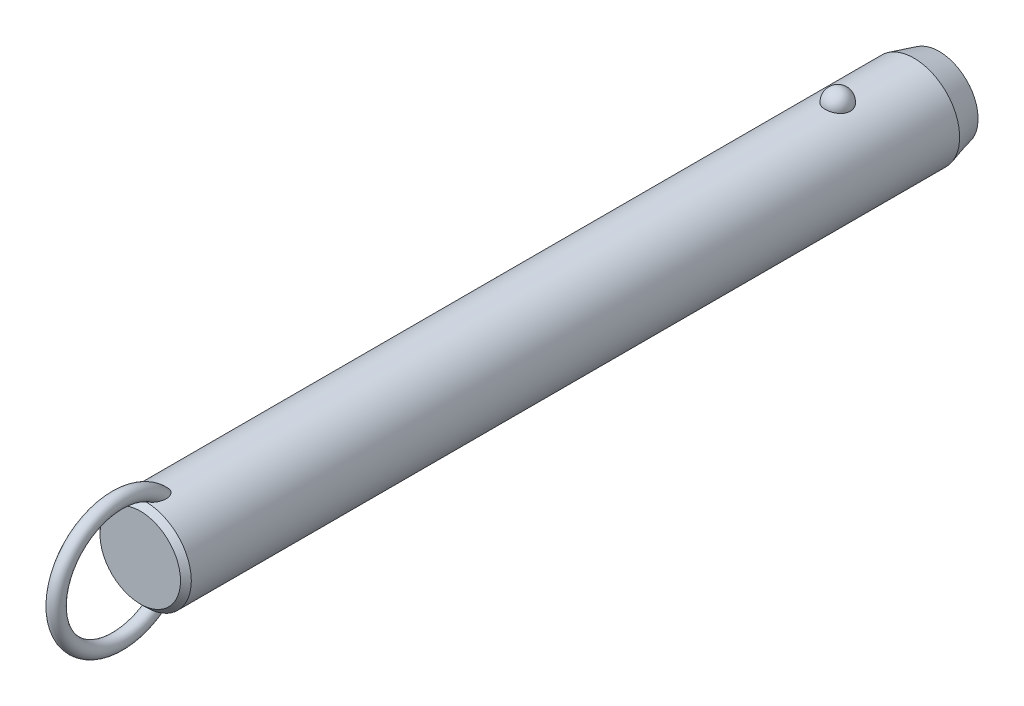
ISO-10303-21;
HEADER;
FILE_DESCRIPTION(('STEP AP214'),'2;1');
FILE_NAME('part.step','',(''),(''),'','','');
FILE_SCHEMA(('AUTOMOTIVE_DESIGN { 1 0 10303 214 1 1 1 1 }'));
ENDSEC;
DATA;
#1=APPLICATION_CONTEXT('core data for automotive mechanical design processes');
#2=APPLICATION_PROTOCOL_DEFINITION('international standard','automotive_design',2000,#1);
#3=PRODUCT_CONTEXT('',#1,'mechanical');
#4=PRODUCT('Part','Part','',(#3));
#5=PRODUCT_RELATED_PRODUCT_CATEGORY('part','',(#4));
#6=PRODUCT_DEFINITION_FORMATION('','',#4);
#7=PRODUCT_DEFINITION_CONTEXT('part definition',#1,'design');
#8=PRODUCT_DEFINITION('design','',#6,#7);
#9=PRODUCT_DEFINITION_SHAPE('','',#8);
#10=(LENGTH_UNIT() NAMED_UNIT(*) SI_UNIT(.MILLI.,.METRE.));
#11=(NAMED_UNIT(*) PLANE_ANGLE_UNIT() SI_UNIT($,.RADIAN.));
#12=(NAMED_UNIT(*) SI_UNIT($,.STERADIAN.) SOLID_ANGLE_UNIT());
#13=UNCERTAINTY_MEASURE_WITH_UNIT(LENGTH_MEASURE(1.E-05),#10,'distance_accuracy_value','');
#14=(GEOMETRIC_REPRESENTATION_CONTEXT(3) GLOBAL_UNCERTAINTY_ASSIGNED_CONTEXT((#13)) GLOBAL_UNIT_ASSIGNED_CONTEXT((#10,
#11,#12)) REPRESENTATION_CONTEXT('',''));
#15=CARTESIAN_POINT('',(0.,0.,0.));
#16=DIRECTION('',(0.,0.,1.));
#17=DIRECTION('',(1.,0.,0.));
#18=AXIS2_PLACEMENT_3D('',#15,#16,#17);
#19=CARTESIAN_POINT('',(0.,0.,177.8));
#20=DIRECTION('',(0.,0.,-1.));
#21=DIRECTION('',(-1.,0.,0.));
#22=AXIS2_PLACEMENT_3D('',#19,#20,#21);
#23=CYLINDRICAL_SURFACE('',#22,12.7);
#24=CARTESIAN_POINT('',(3.46661256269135,12.2177165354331,-3.50000000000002));
#25=CARTESIAN_POINT('',(3.4666090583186,12.2177194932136,-3.30432790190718));
#26=CARTESIAN_POINT('',(3.45063567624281,12.2222841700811,-3.10861112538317));
#27=CARTESIAN_POINT('',(3.38712451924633,12.2400345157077,-2.72271899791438));
#28=CARTESIAN_POINT('',(3.33957415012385,12.2532236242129,-2.53254588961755));
#29=CARTESIAN_POINT('',(3.2141234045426,12.286724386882,-2.16324948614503));
#30=CARTESIAN_POINT('',(3.13623639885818,12.3070329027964,-1.98412136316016));
#31=CARTESIAN_POINT('',(2.95205930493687,12.3525018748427,-1.6418059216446));
#32=CARTESIAN_POINT('',(2.84577003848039,12.3776621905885,-1.47861814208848));
#33=CARTESIAN_POINT('',(2.60688050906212,12.4301712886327,-1.17190583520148));
#34=CARTESIAN_POINT('',(2.47415697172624,12.4575299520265,-1.0284789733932));
#35=CARTESIAN_POINT('',(2.18615174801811,12.5112810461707,-0.766177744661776));
#36=CARTESIAN_POINT('',(2.03087002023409,12.5376734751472,-0.647303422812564));
#37=CARTESIAN_POINT('',(1.70237334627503,12.5864761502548,-0.437732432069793));
#38=CARTESIAN_POINT('',(1.52920948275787,12.6088972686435,-0.346958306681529));
#39=CARTESIAN_POINT('',(1.16944170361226,12.6473352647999,-0.195750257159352));
#40=CARTESIAN_POINT('',(0.982839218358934,12.663352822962,-0.135313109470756));
#41=CARTESIAN_POINT('',(0.604961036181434,12.6869706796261,-0.0473241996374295));
#42=CARTESIAN_POINT('',(0.41382314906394,12.6947125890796,-0.0192185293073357));
#43=CARTESIAN_POINT('',(0.0293827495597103,12.7014203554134,0.00517254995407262));
#44=CARTESIAN_POINT('',(-0.163919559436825,12.7003870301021,0.00146092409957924));
#45=CARTESIAN_POINT('',(-0.544374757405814,12.689735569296,-0.0373939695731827));
#46=CARTESIAN_POINT('',(-0.731575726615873,12.6802364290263,-0.0721015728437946));
#47=CARTESIAN_POINT('',(-1.09733277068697,12.6538333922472,-0.171364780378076));
#48=CARTESIAN_POINT('',(-1.27588869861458,12.6369293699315,-0.235920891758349));
#49=CARTESIAN_POINT('',(-1.6204698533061,12.5973946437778,-0.393548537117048));
#50=CARTESIAN_POINT('',(-1.78641865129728,12.5747321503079,-0.486778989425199));
#51=CARTESIAN_POINT('',(-2.10030671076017,12.5261316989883,-0.699110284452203));
#52=CARTESIAN_POINT('',(-2.24824419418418,12.5001934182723,-0.818213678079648));
#53=CARTESIAN_POINT('',(-2.52491489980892,12.4472906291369,-1.0815712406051));
#54=CARTESIAN_POINT('',(-2.65324222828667,12.4203160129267,-1.22624992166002));
#55=CARTESIAN_POINT('',(-2.88410007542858,12.3687509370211,-1.53528325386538));
#56=CARTESIAN_POINT('',(-2.98662883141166,12.3441606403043,-1.69963924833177));
#57=CARTESIAN_POINT('',(-3.16432417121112,12.2998199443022,-2.04548497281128));
#58=CARTESIAN_POINT('',(-3.23917525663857,12.2801261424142,-2.22714424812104));
#59=CARTESIAN_POINT('',(-3.35800573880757,12.248167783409,-2.60091389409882));
#60=CARTESIAN_POINT('',(-3.4019860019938,12.2359030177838,-2.79302397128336));
#61=CARTESIAN_POINT('',(-3.45784812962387,12.2202347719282,-3.18140279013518));
#62=CARTESIAN_POINT('',(-3.46986123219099,12.2167950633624,-3.37765118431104));
#63=CARTESIAN_POINT('',(-3.46186273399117,12.2190638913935,-3.76943689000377));
#64=CARTESIAN_POINT('',(-3.44185196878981,12.2247721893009,-3.96497421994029));
#65=CARTESIAN_POINT('',(-3.37048652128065,12.2446381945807,-4.34881728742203));
#66=CARTESIAN_POINT('',(-3.31928253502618,12.2587552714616,-4.53715319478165));
#67=CARTESIAN_POINT('',(-3.18693461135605,12.2938237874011,-4.9023172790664));
#68=CARTESIAN_POINT('',(-3.1057895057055,12.3147754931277,-5.07914500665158));
#69=CARTESIAN_POINT('',(-2.91506431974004,12.3613125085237,-5.41732059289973));
#70=CARTESIAN_POINT('',(-2.80533587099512,12.3869217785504,-5.57858147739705));
#71=CARTESIAN_POINT('',(-2.560414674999,12.4398525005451,-5.88013283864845));
#72=CARTESIAN_POINT('',(-2.42522099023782,12.4671740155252,-6.02042254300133));
#73=CARTESIAN_POINT('',(-2.1323357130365,12.5205965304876,-6.27662798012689));
#74=CARTESIAN_POINT('',(-1.97456596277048,12.5466928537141,-6.39245542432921));
#75=CARTESIAN_POINT('',(-1.64115839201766,12.5946384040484,-6.59583547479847));
#76=CARTESIAN_POINT('',(-1.46552179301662,12.6164879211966,-6.68339001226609));
#77=CARTESIAN_POINT('',(-1.10356050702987,12.6532533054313,-6.82682153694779));
#78=CARTESIAN_POINT('',(-0.9173913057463,12.6682500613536,-6.88306988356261));
#79=CARTESIAN_POINT('',(-0.537836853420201,12.6900288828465,-6.96386887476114));
#80=CARTESIAN_POINT('',(-0.344452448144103,12.6968119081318,-6.98842322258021));
#81=CARTESIAN_POINT('',(0.0402577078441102,12.7013667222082,-7.00496469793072));
#82=CARTESIAN_POINT('',(0.231556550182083,12.6993008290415,-6.99753844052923));
#83=CARTESIAN_POINT('',(0.610105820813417,12.6867505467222,-6.95166366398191));
#84=CARTESIAN_POINT('',(0.797356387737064,12.6762664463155,-6.91321620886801));
#85=CARTESIAN_POINT('',(1.16186657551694,12.6480587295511,-6.80658431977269));
#86=CARTESIAN_POINT('',(1.33915951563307,12.6303611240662,-6.73850666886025));
#87=CARTESIAN_POINT('',(1.67968518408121,12.5896027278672,-6.57450875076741));
#88=CARTESIAN_POINT('',(1.84291705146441,12.5665416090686,-6.47858678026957));
#89=CARTESIAN_POINT('',(2.15340192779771,12.5171072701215,-6.25982455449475));
#90=CARTESIAN_POINT('',(2.30037831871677,12.4906895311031,-6.13660186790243));
#91=CARTESIAN_POINT('',(2.5717412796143,12.4376567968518,-5.86739587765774));
#92=CARTESIAN_POINT('',(2.69612388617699,12.4110417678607,-5.72140858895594));
#93=CARTESIAN_POINT('',(2.92107785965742,12.360051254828,-5.40794137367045));
#94=CARTESIAN_POINT('',(3.02121329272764,12.3357209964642,-5.24014110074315));
#95=CARTESIAN_POINT('',(3.19236291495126,12.2925446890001,-4.88969865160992));
#96=CARTESIAN_POINT('',(3.26338839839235,12.2736965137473,-4.70706226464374));
#97=CARTESIAN_POINT('',(3.36788038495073,12.245404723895,-4.35469510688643));
#98=CARTESIAN_POINT('',(3.40484026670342,12.2351018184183,-4.18605935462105));
#99=CARTESIAN_POINT('',(3.45420764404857,12.2212564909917,-3.84496058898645));
#100=CARTESIAN_POINT('',(3.46661565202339,12.2177139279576,-3.67249765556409));
#101=CARTESIAN_POINT('',(3.46661256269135,12.2177165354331,-3.50000000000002));
#102=B_SPLINE_CURVE_WITH_KNOTS('',3,(#24,#25,#26,#27,#28,#29,#30,#31,#32,#33,#34,#35,#36,#37,
#38,#39,#40,#41,#42,#43,#44,#45,#46,#47,#48,#49,#50,#51,#52,#53,#54,#55,#56,#57,#58,#59,#60,#61,
#62,#63,#64,#65,#66,#67,#68,#69,#70,#71,#72,#73,#74,#75,#76,#77,#78,#79,#80,#81,#82,#83,#84,#85,
#86,#87,#88,#89,#90,#91,#92,#93,#94,#95,#96,#97,#98,#99,#100,#101),.UNSPECIFIED.,.T.,.F.,(4,2,2,
2,2,2,2,2,2,2,2,2,2,2,2,2,2,2,2,2,2,2,2,2,2,2,2,2,2,2,2,2,2,2,2,2,2,2,4),(0.,0.586396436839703,
1.17302689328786,1.7593990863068,2.34575431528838,2.93491084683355,3.52406845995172,
4.11158733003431,4.69904375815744,5.2762784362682,5.85345931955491,6.42265312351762,
6.99185659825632,7.56427334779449,8.136746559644,8.71981013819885,9.3029135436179,
9.89247258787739,10.4820150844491,11.0691335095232,11.6562366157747,12.2405256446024,
12.8248374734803,13.412244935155,13.9996740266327,14.5891883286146,15.1786623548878,
15.7609861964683,16.3432419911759,16.9148635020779,17.4864654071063,18.0560241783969,
18.6256177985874,19.2037609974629,19.7820055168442,20.3699810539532,20.957728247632,
21.4746855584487,21.9916320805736),.UNSPECIFIED.);
#103=CARTESIAN_POINT('',(3.46661256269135,12.2177165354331,-3.50000000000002));
#104=VERTEX_POINT('',#103);
#105=EDGE_CURVE('E41',#104,#104,#102,.T.);
#106=ORIENTED_EDGE('',*,*,#105,.T.);
#107=EDGE_LOOP('',(#106));
#108=FACE_BOUND('',#107,.T.);
#109=CARTESIAN_POINT('',(0.,0.,189.));
#110=DIRECTION('',(0.,0.,1.));
#111=DIRECTION('',(1.,0.,0.));
#112=AXIS2_PLACEMENT_3D('',#109,#110,#111);
#113=CIRCLE('',#112,12.7);
#114=CARTESIAN_POINT('',(12.7,0.,189.));
#115=VERTEX_POINT('',#114);
#116=EDGE_CURVE('E10',#115,#115,#113,.F.);
#117=ORIENTED_EDGE('',*,*,#116,.T.);
#118=EDGE_LOOP('',(#117));
#119=FACE_BOUND('',#118,.T.);
#120=CARTESIAN_POINT('',(-0.548122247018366,-12.6881662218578,182.743218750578));
#121=CARTESIAN_POINT('',(-0.648865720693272,-12.6838128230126,182.777926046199));
#122=CARTESIAN_POINT('',(-0.746398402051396,-12.6783867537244,182.822042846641));
#123=CARTESIAN_POINT('',(-0.932125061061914,-12.666091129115,182.926764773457));
#124=CARTESIAN_POINT('',(-1.02030388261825,-12.6592192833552,182.987396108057));
#125=CARTESIAN_POINT('',(-1.18487740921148,-12.6448747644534,183.121847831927));
#126=CARTESIAN_POINT('',(-1.26134296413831,-12.637406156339,183.195582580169));
#127=CARTESIAN_POINT('',(-1.4023120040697,-12.6225412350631,183.353604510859));
#128=CARTESIAN_POINT('',(-1.466814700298,-12.6151449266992,183.43789238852));
#129=CARTESIAN_POINT('',(-1.60714786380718,-12.5981718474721,183.649657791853));
#130=CARTESIAN_POINT('',(-1.67725126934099,-12.588900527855,183.780962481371));
#131=CARTESIAN_POINT('',(-1.79536591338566,-12.5725964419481,184.053247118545));
#132=CARTESIAN_POINT('',(-1.84333535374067,-12.5655679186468,184.194244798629));
#133=CARTESIAN_POINT('',(-1.93422576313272,-12.5519624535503,184.537645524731));
#134=CARTESIAN_POINT('',(-1.96788773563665,-12.5466298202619,184.742557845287));
#135=CARTESIAN_POINT('',(-1.9941399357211,-12.542463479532,185.051760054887));
#136=CARTESIAN_POINT('',(-1.99883864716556,-12.5417153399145,185.155298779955));
#137=CARTESIAN_POINT('',(-2.00078003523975,-12.5414074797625,185.36245124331));
#138=CARTESIAN_POINT('',(-1.99802449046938,-12.5418474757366,185.466064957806));
#139=CARTESIAN_POINT('',(-1.98336733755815,-12.5441750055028,185.71032076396));
#140=CARTESIAN_POINT('',(-1.96851430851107,-12.5465291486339,185.850780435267));
#141=CARTESIAN_POINT('',(-1.92707089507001,-12.5529612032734,186.129960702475));
#142=CARTESIAN_POINT('',(-1.90047458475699,-12.5570399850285,186.268680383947));
#143=CARTESIAN_POINT('',(-1.8361912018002,-12.5666008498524,186.54341135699));
#144=CARTESIAN_POINT('',(-1.79850828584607,-12.57208240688,186.679423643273));
#145=CARTESIAN_POINT('',(-1.71223796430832,-12.5841228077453,186.947842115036));
#146=CARTESIAN_POINT('',(-1.66365679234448,-12.5906810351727,187.080250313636));
#147=CARTESIAN_POINT('',(-1.5780450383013,-12.6016176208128,187.28548877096));
#148=CARTESIAN_POINT('',(-1.54477252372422,-12.6057501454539,187.359914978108));
#149=CARTESIAN_POINT('',(-1.47424480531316,-12.6141930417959,187.506839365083));
#150=CARTESIAN_POINT('',(-1.436990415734,-12.6185033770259,187.579337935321));
#151=CARTESIAN_POINT('',(-1.35825795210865,-12.6272207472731,187.721892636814));
#152=CARTESIAN_POINT('',(-1.31678520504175,-12.6316276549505,187.791951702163));
#153=CARTESIAN_POINT('',(-1.22917793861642,-12.6404532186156,187.929070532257));
#154=CARTESIAN_POINT('',(-1.18304514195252,-12.6448718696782,187.996131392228));
#155=CARTESIAN_POINT('',(-1.07246411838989,-12.6547893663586,188.143874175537));
#156=CARTESIAN_POINT('',(-1.00642239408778,-12.6602600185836,188.223384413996));
#157=CARTESIAN_POINT('',(-0.86444142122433,-12.6707460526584,188.373169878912));
#158=CARTESIAN_POINT('',(-0.788516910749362,-12.6757620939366,188.443458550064));
#159=CARTESIAN_POINT('',(-0.652215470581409,-12.6833591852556,188.548680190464));
#160=CARTESIAN_POINT('',(-0.59498203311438,-12.6861973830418,188.587624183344));
#161=CARTESIAN_POINT('',(-0.475269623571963,-12.6912445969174,188.656489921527));
#162=CARTESIAN_POINT('',(-0.412800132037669,-12.6934547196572,188.686427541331));
#163=CARTESIAN_POINT('',(-0.295749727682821,-12.6966636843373,188.729756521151));
#164=CARTESIAN_POINT('',(-0.241949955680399,-12.6978134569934,188.745218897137));
#165=CARTESIAN_POINT('',(-0.132508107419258,-12.6994261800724,188.766884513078));
#166=CARTESIAN_POINT('',(-0.0768679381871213,-12.6998898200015,188.773097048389));
#167=CARTESIAN_POINT('',(0.0347696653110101,-12.7000752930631,188.775583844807));
#168=CARTESIAN_POINT('',(0.0907676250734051,-12.6997954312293,188.771835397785));
#169=CARTESIAN_POINT('',(0.201283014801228,-12.6985255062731,188.754788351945));
#170=CARTESIAN_POINT('',(0.255799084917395,-12.6975348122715,188.741481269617));
#171=CARTESIAN_POINT('',(0.376042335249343,-12.6946091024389,188.70203792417));
#172=CARTESIAN_POINT('',(0.440950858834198,-12.6924943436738,188.673449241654));
#173=CARTESIAN_POINT('',(0.565350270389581,-12.6875639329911,188.606323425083));
#174=CARTESIAN_POINT('',(0.624828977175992,-12.6847467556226,188.567764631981));
#175=CARTESIAN_POINT('',(0.774116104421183,-12.6767252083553,188.456949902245));
#176=CARTESIAN_POINT('',(0.859449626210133,-12.6711344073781,188.378760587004));
#177=CARTESIAN_POINT('',(1.01789440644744,-12.6593922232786,188.210943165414));
#178=CARTESIAN_POINT('',(1.09096902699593,-12.653239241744,188.121282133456));
#179=CARTESIAN_POINT('',(1.22268793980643,-12.6411674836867,187.940265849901));
#180=CARTESIAN_POINT('',(1.28193986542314,-12.6352572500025,187.849345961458));
#181=CARTESIAN_POINT('',(1.39259777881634,-12.6235401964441,187.662792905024));
#182=CARTESIAN_POINT('',(1.44399707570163,-12.6177334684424,187.567155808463));
#183=CARTESIAN_POINT('',(1.53972870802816,-12.6064093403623,187.372273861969));
#184=CARTESIAN_POINT('',(1.58405262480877,-12.6008922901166,187.273024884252));
#185=CARTESIAN_POINT('',(1.66600705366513,-12.5903187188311,187.071772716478));
#186=CARTESIAN_POINT('',(1.70363651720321,-12.5852622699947,186.969769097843));
#187=CARTESIAN_POINT('',(1.77545379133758,-12.5753406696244,186.754358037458));
#188=CARTESIAN_POINT('',(1.80903453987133,-12.5705328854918,186.640745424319));
#189=CARTESIAN_POINT('',(1.86844163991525,-12.5618400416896,186.411457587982));
#190=CARTESIAN_POINT('',(1.89426665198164,-12.5579551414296,186.295782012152));
#191=CARTESIAN_POINT('',(1.9378546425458,-12.5513030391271,186.063007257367));
#192=CARTESIAN_POINT('',(1.9556264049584,-12.5485346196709,185.945909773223));
#193=CARTESIAN_POINT('',(1.98264463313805,-12.5442934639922,185.710747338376));
#194=CARTESIAN_POINT('',(1.99189298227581,-12.5428204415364,185.59268260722));
#195=CARTESIAN_POINT('',(2.00416068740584,-12.540871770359,185.280622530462));
#196=CARTESIAN_POINT('',(1.99944433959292,-12.541631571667,185.086229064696));
#197=CARTESIAN_POINT('',(1.96113755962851,-12.5476846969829,184.700309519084));
#198=CARTESIAN_POINT('',(1.92758341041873,-12.5529723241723,184.508780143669));
#199=CARTESIAN_POINT('',(1.83934342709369,-12.5661532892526,184.182272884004));
#200=CARTESIAN_POINT('',(1.79215440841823,-12.5730485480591,184.04524997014));
#201=CARTESIAN_POINT('',(1.67676242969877,-12.588958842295,183.780445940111));
#202=CARTESIAN_POINT('',(1.60859050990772,-12.597970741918,183.652651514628));
#203=CARTESIAN_POINT('',(1.46583832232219,-12.6152829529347,183.435800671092));
#204=CARTESIAN_POINT('',(1.39525727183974,-12.6233659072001,183.34410500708));
#205=CARTESIAN_POINT('',(1.23992594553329,-12.6395676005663,183.173485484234));
#206=CARTESIAN_POINT('',(1.15517932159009,-12.6476863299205,183.094558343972));
#207=CARTESIAN_POINT('',(0.971995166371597,-12.6630846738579,182.952643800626));
#208=CARTESIAN_POINT('',(0.873456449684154,-12.6703572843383,182.889784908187));
#209=CARTESIAN_POINT('',(0.665847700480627,-12.6829569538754,182.784487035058));
#210=CARTESIAN_POINT('',(0.556784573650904,-12.688285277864,182.742034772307));
#211=CARTESIAN_POINT('',(0.347338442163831,-12.6956226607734,182.684443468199));
#212=CARTESIAN_POINT('',(0.247759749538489,-12.6979816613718,182.666399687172));
#213=CARTESIAN_POINT('',(0.0470218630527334,-12.7003077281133,182.648600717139));
#214=CARTESIAN_POINT('',(-0.0541350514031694,-12.7002779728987,182.648821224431));
#215=CARTESIAN_POINT('',(-0.221414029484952,-12.6982482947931,182.664363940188));
#216=CARTESIAN_POINT('',(-0.288055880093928,-12.6969033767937,182.674666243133));
#217=CARTESIAN_POINT('',(-0.419599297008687,-12.6932369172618,182.70313489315));
#218=CARTESIAN_POINT('',(-0.484501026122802,-12.6909154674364,182.721300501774));
#219=CARTESIAN_POINT('',(-0.548122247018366,-12.6881662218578,182.743218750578));
#220=B_SPLINE_CURVE_WITH_KNOTS('',3,(#120,#121,#122,#123,#124,#125,#126,#127,#128,#129,#130,
#131,#132,#133,#134,#135,#136,#137,#138,#139,#140,#141,#142,#143,#144,#145,#146,#147,#148,#149,
#150,#151,#152,#153,#154,#155,#156,#157,#158,#159,#160,#161,#162,#163,#164,#165,#166,#167,#168,
#169,#170,#171,#172,#173,#174,#175,#176,#177,#178,#179,#180,#181,#182,#183,#184,#185,#186,#187,
#188,#189,#190,#191,#192,#193,#194,#195,#196,#197,#198,#199,#200,#201,#202,#203,#204,#205,#206,
#207,#208,#209,#210,#211,#212,#213,#214,#215,#216,#217,#218,#219),.UNSPECIFIED.,.T.,.F.,(4,2,2,
2,2,2,2,2,2,2,2,2,2,2,2,2,2,2,2,2,2,2,2,2,2,2,2,2,2,2,2,2,2,2,2,2,2,2,2,2,2,2,2,2,2,2,2,2,2,4),
(0.,0.31964225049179,0.639794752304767,0.957927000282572,1.27608021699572,1.72100165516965,
2.16675988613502,2.78630021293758,3.09705782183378,3.40774128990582,3.83096358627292,
4.25439969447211,4.67767724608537,5.10071330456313,5.34550297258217,5.59024267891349,
5.83467707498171,6.07902143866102,6.38891080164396,6.69834321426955,6.9056091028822,
7.11250749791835,7.27977315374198,7.44687060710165,7.61434932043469,7.78197685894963,
7.99365544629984,8.20579780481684,8.55147335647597,8.89816429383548,9.22375138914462,
9.54961437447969,9.8758622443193,10.202161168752,10.557587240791,10.9130746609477,
11.2681734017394,11.6231936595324,12.2046601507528,12.7853961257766,13.219164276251,
13.6522938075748,13.9989174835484,14.3454519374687,14.6946768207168,15.0436740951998,
15.3457513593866,15.6474266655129,15.8493051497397,16.0511646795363),.UNSPECIFIED.);
#221=CARTESIAN_POINT('',(-0.548122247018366,-12.6881662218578,182.743218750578));
#222=VERTEX_POINT('',#221);
#223=EDGE_CURVE('E60',#222,#222,#220,.T.);
#224=ORIENTED_EDGE('',*,*,#223,.T.);
#225=EDGE_LOOP('',(#224));
#226=FACE_BOUND('',#225,.T.);
#227=CARTESIAN_POINT('',(-0.548122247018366,12.6881662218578,182.743218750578));
#228=CARTESIAN_POINT('',(-0.459436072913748,12.6919968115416,182.712673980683));
#229=CARTESIAN_POINT('',(-0.368189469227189,12.6949996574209,182.689391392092));
#230=CARTESIAN_POINT('',(-0.183024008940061,12.6990186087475,182.658406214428));
#231=CARTESIAN_POINT('',(-0.0891049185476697,12.7000345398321,182.650704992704));
#232=CARTESIAN_POINT('',(0.098714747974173,12.6999636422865,182.651245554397));
#233=CARTESIAN_POINT('',(0.192615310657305,12.6988761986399,182.659492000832));
#234=CARTESIAN_POINT('',(0.377658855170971,12.6947211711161,182.691551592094));
#235=CARTESIAN_POINT('',(0.468801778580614,12.6916535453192,182.715365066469));
#236=CARTESIAN_POINT('',(0.645809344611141,12.6838788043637,182.77745651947));
#237=CARTESIAN_POINT('',(0.731679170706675,12.6791733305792,182.815720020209));
#238=CARTESIAN_POINT('',(0.896315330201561,12.6686004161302,182.905120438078));
#239=CARTESIAN_POINT('',(0.975080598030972,12.6627328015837,182.956259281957));
#240=CARTESIAN_POINT('',(1.12963655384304,12.6499161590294,183.07367820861));
#241=CARTESIAN_POINT('',(1.20478673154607,12.6429194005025,183.140792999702));
#242=CARTESIAN_POINT('',(1.34448241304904,12.6288282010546,183.28522507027));
#243=CARTESIAN_POINT('',(1.40902173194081,12.621733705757,183.362548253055));
#244=CARTESIAN_POINT('',(1.55208211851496,12.6050877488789,183.559247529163));
#245=CARTESIAN_POINT('',(1.62510490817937,12.5957546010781,183.682654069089));
#246=CARTESIAN_POINT('',(1.7501904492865,12.5789823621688,183.939769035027));
#247=CARTESIAN_POINT('',(1.80221377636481,12.5715468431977,184.073496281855));
#248=CARTESIAN_POINT('',(1.90309965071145,12.5567434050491,184.398351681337));
#249=CARTESIAN_POINT('',(1.94342317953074,12.5504515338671,184.592161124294));
#250=CARTESIAN_POINT('',(1.99332997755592,12.5426147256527,184.98378810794));
#251=CARTESIAN_POINT('',(2.00285305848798,12.5410790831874,185.181612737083));
#252=CARTESIAN_POINT('',(1.99678999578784,12.5420407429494,185.516642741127));
#253=CARTESIAN_POINT('',(1.98794117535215,12.5434564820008,185.654042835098));
#254=CARTESIAN_POINT('',(1.95865119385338,12.5480641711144,185.927639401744));
#255=CARTESIAN_POINT('',(1.93820436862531,12.5512569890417,186.063835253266));
#256=CARTESIAN_POINT('',(1.88647896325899,12.5591352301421,186.334249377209));
#257=CARTESIAN_POINT('',(1.85518800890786,12.5638223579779,186.468465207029));
#258=CARTESIAN_POINT('',(1.78217886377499,12.5743868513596,186.733936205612));
#259=CARTESIAN_POINT('',(1.74046509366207,12.5802637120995,186.865192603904));
#260=CARTESIAN_POINT('',(1.66024095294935,12.5910571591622,187.086085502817));
#261=CARTESIAN_POINT('',(1.62434772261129,12.5957535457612,187.176690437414));
#262=CARTESIAN_POINT('',(1.54709009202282,12.6054762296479,187.355512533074));
#263=CARTESIAN_POINT('',(1.50572681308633,12.6105024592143,187.443730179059));
#264=CARTESIAN_POINT('',(1.41728020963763,12.620748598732,187.616932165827));
#265=CARTESIAN_POINT('',(1.37021377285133,12.625967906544,187.701925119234));
#266=CARTESIAN_POINT('',(1.26969620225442,12.6364721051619,187.868007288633));
#267=CARTESIAN_POINT('',(1.21624929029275,12.6417569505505,187.949099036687));
#268=CARTESIAN_POINT('',(1.10304413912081,12.6521331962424,188.104702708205));
#269=CARTESIAN_POINT('',(1.04340936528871,12.657226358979,188.179303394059));
#270=CARTESIAN_POINT('',(0.915919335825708,12.667090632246,188.321324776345));
#271=CARTESIAN_POINT('',(0.848064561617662,12.6718617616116,188.38874589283));
#272=CARTESIAN_POINT('',(0.717035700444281,12.67987711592,188.500624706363));
#273=CARTESIAN_POINT('',(0.655526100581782,12.6832377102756,188.546997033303));
#274=CARTESIAN_POINT('',(0.525985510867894,12.6892676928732,188.629619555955));
#275=CARTESIAN_POINT('',(0.457969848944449,12.6919386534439,188.665892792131));
#276=CARTESIAN_POINT('',(0.334859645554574,12.695691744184,188.716657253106));
#277=CARTESIAN_POINT('',(0.281116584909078,12.6970073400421,188.734373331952));
#278=CARTESIAN_POINT('',(0.171425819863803,12.6989609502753,188.760642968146));
#279=CARTESIAN_POINT('',(0.115480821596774,12.699599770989,188.769207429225));
#280=CARTESIAN_POINT('',(0.00272618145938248,12.7001251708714,188.776253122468));
#281=CARTESIAN_POINT('',(-0.054085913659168,12.7000089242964,188.774696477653));
#282=CARTESIAN_POINT('',(-0.166544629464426,12.6990328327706,188.761600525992));
#283=CARTESIAN_POINT('',(-0.222190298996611,12.6981724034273,188.750053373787));
#284=CARTESIAN_POINT('',(-0.342018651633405,12.695562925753,188.714912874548));
#285=CARTESIAN_POINT('',(-0.405606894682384,12.6936676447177,188.68933225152));
#286=CARTESIAN_POINT('',(-0.527815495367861,12.6891754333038,188.628311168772));
#287=CARTESIAN_POINT('',(-0.586425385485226,12.6865770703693,188.592850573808));
#288=CARTESIAN_POINT('',(-0.731842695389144,12.6792129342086,188.491496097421));
#289=CARTESIAN_POINT('',(-0.81470941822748,12.6740767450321,188.4200395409));
#290=CARTESIAN_POINT('',(-0.969101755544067,12.6632083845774,188.26589007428));
#291=CARTESIAN_POINT('',(-1.04059564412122,12.6574746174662,188.183166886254));
#292=CARTESIAN_POINT('',(-1.16981116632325,12.6461638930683,188.015809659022));
#293=CARTESIAN_POINT('',(-1.22811369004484,12.6405994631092,187.931616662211));
#294=CARTESIAN_POINT('',(-1.33743405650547,12.6295007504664,187.758579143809));
#295=CARTESIAN_POINT('',(-1.38844577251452,12.6239664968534,187.669730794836));
#296=CARTESIAN_POINT('',(-1.48400702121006,12.6130898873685,187.488389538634));
#297=CARTESIAN_POINT('',(-1.52854232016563,12.6077479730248,187.395889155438));
#298=CARTESIAN_POINT('',(-1.61150113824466,12.5974127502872,187.208160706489));
#299=CARTESIAN_POINT('',(-1.64992317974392,12.5924195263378,187.112931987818));
#300=CARTESIAN_POINT('',(-1.73468589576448,12.581070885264,186.88289362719));
#301=CARTESIAN_POINT('',(-1.77831261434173,12.5749388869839,186.747066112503));
#302=CARTESIAN_POINT('',(-1.85439734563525,12.5639437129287,186.472212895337));
#303=CARTESIAN_POINT('',(-1.88684994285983,12.5590811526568,186.333185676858));
#304=CARTESIAN_POINT('',(-1.94008483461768,12.550968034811,186.05309235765));
#305=CARTESIAN_POINT('',(-1.96088706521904,12.5477147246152,185.912030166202));
#306=CARTESIAN_POINT('',(-1.99000539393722,12.5431291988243,185.628668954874));
#307=CARTESIAN_POINT('',(-1.99832911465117,12.5417958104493,185.486370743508));
#308=CARTESIAN_POINT('',(-2.00166624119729,12.5412674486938,185.157627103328));
#309=CARTESIAN_POINT('',(-1.99178843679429,12.5428579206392,184.971088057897));
#310=CARTESIAN_POINT('',(-1.94455183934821,12.5502731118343,184.60162404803));
#311=CARTESIAN_POINT('',(-1.90724032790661,12.5560905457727,184.418693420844));
#312=CARTESIAN_POINT('',(-1.81330718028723,12.5699462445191,184.104848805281));
#313=CARTESIAN_POINT('',(-1.76338820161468,12.5771273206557,183.971910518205));
#314=CARTESIAN_POINT('',(-1.64305018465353,12.593414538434,183.715681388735));
#315=CARTESIAN_POINT('',(-1.57265346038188,12.6025185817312,183.592380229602));
#316=CARTESIAN_POINT('',(-1.42634956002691,12.6198178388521,183.383564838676));
#317=CARTESIAN_POINT('',(-1.35423772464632,12.6278405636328,183.295384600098));
#318=CARTESIAN_POINT('',(-1.19645664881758,12.6437632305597,183.132107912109));
#319=CARTESIAN_POINT('',(-1.1108053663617,12.6516633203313,183.056994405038));
#320=CARTESIAN_POINT('',(-0.947219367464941,12.6648319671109,182.937811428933));
#321=CARTESIAN_POINT('',(-0.871624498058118,12.670300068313,182.890541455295));
#322=CARTESIAN_POINT('',(-0.714161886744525,12.6801492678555,182.8077413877));
#323=CARTESIAN_POINT('',(-0.632295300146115,12.684530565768,182.77220913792));
#324=CARTESIAN_POINT('',(-0.548122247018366,12.6881662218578,182.743218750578));
#325=B_SPLINE_CURVE_WITH_KNOTS('',3,(#227,#228,#229,#230,#231,#232,#233,#234,#235,#236,#237,
#238,#239,#240,#241,#242,#243,#244,#245,#246,#247,#248,#249,#250,#251,#252,#253,#254,#255,#256,
#257,#258,#259,#260,#261,#262,#263,#264,#265,#266,#267,#268,#269,#270,#271,#272,#273,#274,#275,
#276,#277,#278,#279,#280,#281,#282,#283,#284,#285,#286,#287,#288,#289,#290,#291,#292,#293,#294,
#295,#296,#297,#298,#299,#300,#301,#302,#303,#304,#305,#306,#307,#308,#309,#310,#311,#312,#313,
#314,#315,#316,#317,#318,#319,#320,#321,#322,#323,#324),.UNSPECIFIED.,.T.,.F.,(4,2,2,2,2,2,2,2,
2,2,2,2,2,2,2,2,2,2,2,2,2,2,2,2,2,2,2,2,2,2,2,2,2,2,2,2,2,2,2,2,2,2,2,2,2,2,2,2,4),(0.,
0.281328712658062,0.562682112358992,0.844117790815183,1.12555942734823,1.40671982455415,
1.68792232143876,1.98972294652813,2.29169886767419,2.72039860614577,3.14989948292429,
3.74084916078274,4.33295293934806,4.74554109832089,5.15833092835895,5.57159335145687,
5.98468079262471,6.27722775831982,6.56971484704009,6.86135609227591,7.15280542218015,
7.43927407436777,7.72572595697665,7.95635862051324,8.18646071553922,8.35559393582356,
8.52452541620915,8.69408946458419,8.86378678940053,9.06834348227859,9.27332014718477,
9.60010414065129,9.92778432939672,10.2350252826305,10.5425229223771,10.8506864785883,
11.15892440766,11.5867893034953,12.0148612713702,12.4421984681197,12.8692745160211,
13.4279365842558,13.9856380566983,14.4107062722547,14.835313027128,15.1765567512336,
15.517351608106,15.7844129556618,16.051425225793),.UNSPECIFIED.);
#326=CARTESIAN_POINT('',(-0.548122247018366,12.6881662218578,182.743218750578));
#327=VERTEX_POINT('',#326);
#328=EDGE_CURVE('E68',#327,#327,#325,.T.);
#329=ORIENTED_EDGE('',*,*,#328,.T.);
#330=EDGE_LOOP('',(#329));
#331=FACE_BOUND('',#330,.T.);
#332=CARTESIAN_POINT('',(0.,0.,-24.6999999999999));
#333=DIRECTION('',(0.,0.,-1.));
#334=DIRECTION('',(-1.,0.,0.));
#335=AXIS2_PLACEMENT_3D('',#332,#333,#334);
#336=CIRCLE('',#335,12.7);
#337=CARTESIAN_POINT('',(-12.7,0.,-24.6999999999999));
#338=VERTEX_POINT('',#337);
#339=EDGE_CURVE('E57',#338,#338,#336,.F.);
#340=ORIENTED_EDGE('',*,*,#339,.T.);
#341=EDGE_LOOP('',(#340));
#342=FACE_BOUND('',#341,.T.);
#343=ADVANCED_FACE('F37',(#108,#119,#226,#331,#342),#23,.T.);
#344=CARTESIAN_POINT('',(0.,0.,-31.7));
#345=DIRECTION('',(0.,0.,-1.));
#346=DIRECTION('',(-1.,0.,0.));
#347=AXIS2_PLACEMENT_3D('',#344,#345,#346);
#348=PLANE('',#347);
#349=CARTESIAN_POINT('',(0.,0.,-31.7));
#350=DIRECTION('',(0.,0.,-1.));
#351=DIRECTION('',(-1.,0.,0.));
#352=AXIS2_PLACEMENT_3D('',#349,#350,#351);
#353=CIRCLE('',#352,10.8243556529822);
#354=CARTESIAN_POINT('',(-10.8243556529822,0.,-31.7));
#355=VERTEX_POINT('',#354);
#356=EDGE_CURVE('E67',#355,#355,#353,.T.);
#357=ORIENTED_EDGE('',*,*,#356,.T.);
#358=EDGE_LOOP('',(#357));
#359=FACE_BOUND('',#358,.T.);
#360=ADVANCED_FACE('F86',(#359),#348,.T.);
#361=CARTESIAN_POINT('',(0.,0.,-31.7));
#362=DIRECTION('',(0.,0.,1.));
#363=DIRECTION('',(1.,0.,0.));
#364=AXIS2_PLACEMENT_3D('',#361,#362,#363);
#365=CONICAL_SURFACE('',#364,10.8243556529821,0.261799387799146);
#366=ORIENTED_EDGE('',*,*,#339,.F.);
#367=EDGE_LOOP('',(#366));
#368=FACE_BOUND('',#367,.T.);
#369=ORIENTED_EDGE('',*,*,#356,.F.);
#370=EDGE_LOOP('',(#369));
#371=FACE_BOUND('',#370,.T.);
#372=ADVANCED_FACE('F84',(#368,#371),#365,.T.);
#373=CARTESIAN_POINT('',(0.,0.,190.5));
#374=DIRECTION('',(0.,0.,1.));
#375=DIRECTION('',(1.,0.,0.));
#376=AXIS2_PLACEMENT_3D('',#373,#374,#375);
#377=PLANE('',#376);
#378=CARTESIAN_POINT('',(0.,0.,190.5));
#379=DIRECTION('',(0.,0.,1.));
#380=DIRECTION('',(1.,0.,0.));
#381=AXIS2_PLACEMENT_3D('',#378,#379,#380);
#382=CIRCLE('',#381,11.1999999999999);
#383=CARTESIAN_POINT('',(11.1999999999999,0.,190.5));
#384=VERTEX_POINT('',#383);
#385=EDGE_CURVE('E50',#384,#384,#382,.T.);
#386=ORIENTED_EDGE('',*,*,#385,.T.);
#387=EDGE_LOOP('',(#386));
#388=FACE_BOUND('',#387,.T.);
#389=ADVANCED_FACE('F78',(#388),#377,.T.);
#390=CARTESIAN_POINT('',(0.,0.,196.85));
#391=DIRECTION('',(1.,0.,0.));
#392=DIRECTION('',(0.,0.,-1.));
#393=AXIS2_PLACEMENT_3D('',#390,#391,#392);
#394=TOROIDAL_SURFACE('',#393,17.05,2.);
#395=ORIENTED_EDGE('',*,*,#328,.F.);
#396=EDGE_LOOP('',(#395));
#397=FACE_BOUND('',#396,.T.);
#398=ORIENTED_EDGE('',*,*,#223,.F.);
#399=EDGE_LOOP('',(#398));
#400=FACE_BOUND('',#399,.T.);
#401=ADVANCED_FACE('F74',(#397,#400),#394,.T.);
#402=CARTESIAN_POINT('',(0.,0.,190.5));
#403=DIRECTION('',(0.,0.,-1.));
#404=DIRECTION('',(-1.,0.,0.));
#405=AXIS2_PLACEMENT_3D('',#402,#403,#404);
#406=CONICAL_SURFACE('',#405,11.1999999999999,0.785398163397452);
#407=ORIENTED_EDGE('',*,*,#116,.F.);
#408=EDGE_LOOP('',(#407));
#409=FACE_BOUND('',#408,.T.);
#410=ORIENTED_EDGE('',*,*,#385,.F.);
#411=EDGE_LOOP('',(#410));
#412=FACE_BOUND('',#411,.T.);
#413=ADVANCED_FACE('F39',(#409,#412),#406,.T.);
#414=CARTESIAN_POINT('',(0.,12.7,-3.50000000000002));
#415=DIRECTION('',(0.,1.,0.));
#416=DIRECTION('',(0.,0.,-1.));
#417=AXIS2_PLACEMENT_3D('',#414,#415,#416);
#418=SPHERICAL_SURFACE('',#417,3.5);
#419=ORIENTED_EDGE('',*,*,#105,.F.);
#420=EDGE_LOOP('',(#419));
#421=FACE_BOUND('',#420,.T.);
#422=ADVANCED_FACE('F80',(#421),#418,.T.);
#423=CLOSED_SHELL('',(#343,#360,#372,#389,#401,#413,#422));
#424=MANIFOLD_SOLID_BREP('B2',#423);
#425=ADVANCED_BREP_SHAPE_REPRESENTATION('',(#18,#424),#14);
#426=SHAPE_DEFINITION_REPRESENTATION(#9,#425);
ENDSEC;
END-ISO-10303-21;
